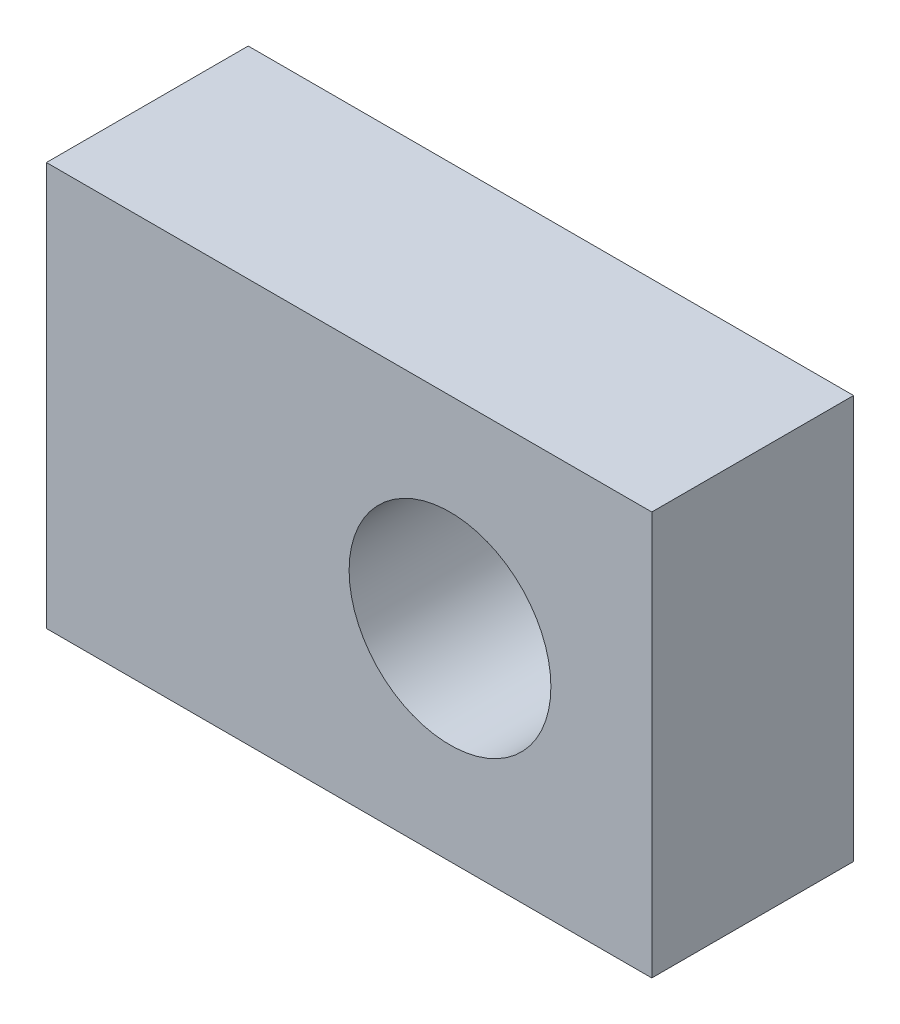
from build123d import *

# Parameters (mm, degrees)
SKETCH1_W      = 38.1
SKETCH1_H      = 25.4
SKETCH1_R      = 6.35
EXTRUDE1_DEPTH = 12.7


with BuildPart() as part:
    # Sketch1 → Extrude1 (new body)
    with BuildSketch(Plane.XY):
        with Locations((29.915660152, 4.490605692)):
            Rectangle(SKETCH1_W, SKETCH1_H)
        with Locations((36.265660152, 4.490605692)):
            Circle(SKETCH1_R, mode=Mode.SUBTRACT)
    extrude(amount=EXTRUDE1_DEPTH)


solid = part.part
